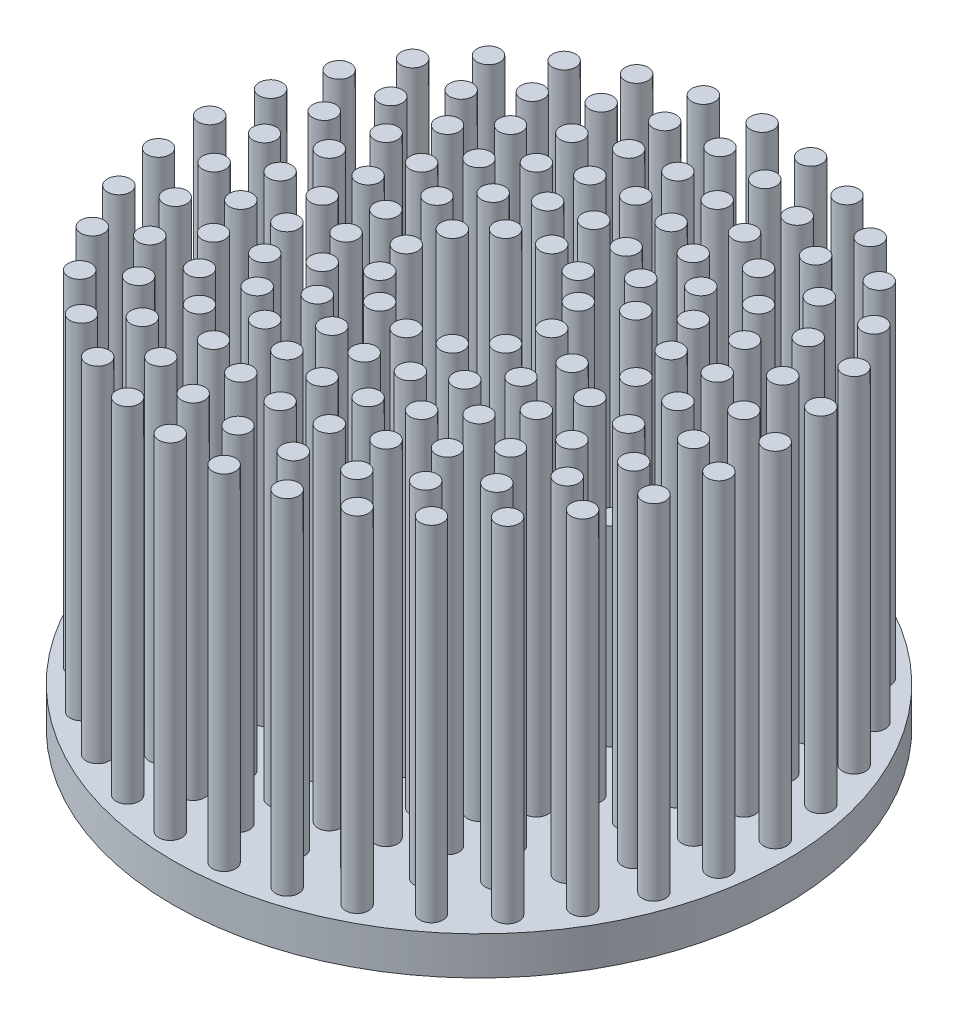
from build123d import *

# Parameters (mm, degrees)
SKETCH_1_R                = 40
EXTRUDE_1_DEPTH           = 3
SKETCH_2_R                = 1.5
EXTRUDE_2_DEPTH           = 27
SKETCH_6_R                = 1.5
EXTRUDE_4_DEPTH           = 27
PATTERN_CIRCULAR_3_COUNT  = 6
SKETCH_7_R                = 1.5
EXTRUDE_5_DEPTH           = 27
PATTERN_CIRCULAR_4_COUNT  = 12
SKETCH_8_R                = 1.5
EXTRUDE_6_DEPTH           = 27
PATTERN_CIRCULAR_5_COUNT  = 18
SKETCH_10_R               = 1.5
EXTRUDE_7_DEPTH           = 27
PATTERN_CIRCULAR_6_COUNT  = 24
SKETCH_11_R               = 1.5
EXTRUDE_8_DEPTH           = 27
PATTERN_CIRCULAR_7_COUNT  = 28
SKETCH_13_R               = 7
CUT_EXTRUDE_3_DEPTH       = 27
SKETCH_15_R               = 1.5
EXTRUDE_10_DEPTH          = 27
PATTERN_CIRCULAR_8_COUNT  = 5
SKETCH_23_R               = 1.5
EXTRUDE_16_DEPTH          = 27
PATTERN_CIRCULAR_9_COUNT  = 30
SKETCH_26_R               = 1.5
EXTRUDE_17_DEPTH          = 27
PATTERN_CIRCULAR_10_COUNT = 33
SKETCH_29_R               = 1.5
EXTRUDE_19_DEPTH          = 37
SKETCH_30_R               = 40
EXTRUDE_20_DEPTH          = 2
M2X0_4_TAPPED_HOLE1_D     = 1.6
M2X0_4_TAPPED_HOLE1_DEPTH = 6
M2X0_4_TAPPED_HOLE1_TIP   = 0.480688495
SKETCH6_R                 = 5.75
EXTRUDE2_DEPTH            = 70.282032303
SKETCH7_R                 = 45.51337789
EXTRUDE3_DEPTH            = 10
SKETCH8_R                 = 1.5
EXTRUDE4_DEPTH            = 20


with BuildPart() as part:
    # Sketch 1 → Extrude 1 (new body)
    with BuildSketch(Plane(origin=(0, 0, 0), x_dir=(1, 0, 0), z_dir=(0, 1, 0))):
        with Locations(Location((0, 0, 0), (0, 0, 270))):
            Circle(SKETCH_1_R)
    extrude(amount=EXTRUDE_1_DEPTH)

    # Sketch 2 → Extrude 2 (add)
    with BuildSketch(Plane(origin=(0, 3, 0), x_dir=(1, 0, 0), z_dir=(0, 1, 0))):
        with Locations(Location((0, 0, 0), (0, 0, 270))):
            Circle(SKETCH_2_R)
    extrude(amount=EXTRUDE_2_DEPTH)

    # Sketch 6 → Extrude 4 (add)
    with BuildSketch(Plane(origin=(0, 3, 0), x_dir=(1, 0, 0), z_dir=(0, 1, 0))):
        with Locations(Location((0, 5.5, 0), (0, 0, 270))):
            Circle(SKETCH_6_R)
    extrude_4 = extrude(amount=EXTRUDE_4_DEPTH)

    # Pattern Circular 3: Extrude 4 ×6 about axis
    pattern_circular_3_axis = Axis((0, 0, 0), (0, 1, 0))
    for i in range(1, PATTERN_CIRCULAR_3_COUNT):
        add(extrude_4.rotate(pattern_circular_3_axis, i * 360 / PATTERN_CIRCULAR_3_COUNT))

    # Sketch 7 → Extrude 5 (add)
    with BuildSketch(Plane(origin=(0, 3, 0), x_dir=(1, 0, 0), z_dir=(0, 1, 0))):
        with Locations(Location((0, 9.5, 0), (0, 0, 270))):
            Circle(SKETCH_7_R)
    extrude_5 = extrude(amount=EXTRUDE_5_DEPTH)

    # Pattern Circular 4: Extrude 5 ×12 about axis
    pattern_circular_4_axis = Axis((0, 0, 0), (0, 1, 0))
    for i in range(1, PATTERN_CIRCULAR_4_COUNT):
        add(extrude_5.rotate(pattern_circular_4_axis, i * 360 / PATTERN_CIRCULAR_4_COUNT))

    # Sketch 8 → Extrude 6 (add)
    with BuildSketch(Plane(origin=(0, 3, 0), x_dir=(1, 0, 0), z_dir=(0, 1, 0))):
        with Locations(Location((0, 15, 0), (0, 0, 270))):
            Circle(SKETCH_8_R)
    extrude_6 = extrude(amount=EXTRUDE_6_DEPTH)

    # Pattern Circular 5: Extrude 6 ×18 about axis
    pattern_circular_5_axis = Axis((0, 0, 0), (0, 1, 0))
    for i in range(1, PATTERN_CIRCULAR_5_COUNT):
        add(extrude_6.rotate(pattern_circular_5_axis, i * 360 / PATTERN_CIRCULAR_5_COUNT))

    # Sketch 10 → Extrude 7 (add)
    with BuildSketch(Plane(origin=(0, 3, 0), x_dir=(1, 0, 0), z_dir=(0, 1, 0))):
        with Locations(Location((0, 20.5, 0), (0, 0, 270))):
            Circle(SKETCH_10_R)
    extrude_7 = extrude(amount=EXTRUDE_7_DEPTH)

    # Pattern Circular 6: Extrude 7 ×24 about axis
    pattern_circular_6_axis = Axis((0, 0, 0), (0, 1, 0))
    for i in range(1, PATTERN_CIRCULAR_6_COUNT):
        add(extrude_7.rotate(pattern_circular_6_axis, i * 360 / PATTERN_CIRCULAR_6_COUNT))

    # Sketch 11 → Extrude 8 (add)
    with BuildSketch(Plane(origin=(0, 3, 0), x_dir=(1, 0, 0), z_dir=(0, 1, 0))):
        with Locations(Location((0, 26, 0), (0, 0, 270))):
            Circle(SKETCH_11_R)
    extrude_8 = extrude(amount=EXTRUDE_8_DEPTH)

    # Pattern Circular 7: Extrude 8 ×28 about axis
    pattern_circular_7_axis = Axis((0, 0, 0), (0, 1, 0))
    for i in range(1, PATTERN_CIRCULAR_7_COUNT):
        add(extrude_8.rotate(pattern_circular_7_axis, i * 360 / PATTERN_CIRCULAR_7_COUNT))

    # Sketch 13 → Cut-Extrude 3 (cut)
    with BuildSketch(Plane(origin=(0, 3, 0), x_dir=(1, 0, 0), z_dir=(0, 1, 0))):
        Circle(SKETCH_13_R)
    extrude(amount=CUT_EXTRUDE_3_DEPTH, mode=Mode.SUBTRACT)

    # Sketch 15 → Extrude 10 (add)
    with BuildSketch(Plane(origin=(0, 3, 0), x_dir=(1, 0, 0), z_dir=(0, 1, 0))):
        with Locations(Location((0, 4, 0), (0, 0, 270))):
            Circle(SKETCH_15_R)
    extrude_10 = extrude(amount=EXTRUDE_10_DEPTH)

    # Pattern Circular 8: Extrude 10 ×5 about axis
    pattern_circular_8_axis = Axis((0, 0, 0), (0, 1, 0))
    for i in range(1, PATTERN_CIRCULAR_8_COUNT):
        add(extrude_10.rotate(pattern_circular_8_axis, i * 360 / PATTERN_CIRCULAR_8_COUNT))

    # Sketch 23 → Extrude 16 (add)
    with BuildSketch(Plane(origin=(0, 3, 0), x_dir=(1, 0, 0), z_dir=(0, 1, 0))):
        with Locations(Location((0, 31.5, 0), (0, 0, 270))):
            Circle(SKETCH_23_R)
    extrude_16 = extrude(amount=EXTRUDE_16_DEPTH)

    # Pattern Circular 9: Extrude 16 ×30 about axis
    pattern_circular_9_axis = Axis((0, 0, 0), (0, 1, 0))
    for i in range(1, PATTERN_CIRCULAR_9_COUNT):
        add(extrude_16.rotate(pattern_circular_9_axis, i * 360 / PATTERN_CIRCULAR_9_COUNT))

    # Sketch 26 → Extrude 17 (add)
    with BuildSketch(Plane(origin=(0, 3, 0), x_dir=(1, 0, 0), z_dir=(0, 1, 0))):
        with Locations(Location((0, 37, 0), (0, 0, 270))):
            Circle(SKETCH_26_R)
    extrude_17 = extrude(amount=EXTRUDE_17_DEPTH)

    # Pattern Circular 10: Extrude 17 ×33 about axis
    pattern_circular_10_axis = Axis((0, 0, 0), (0, 1, 0))
    for i in range(1, PATTERN_CIRCULAR_10_COUNT):
        add(extrude_17.rotate(pattern_circular_10_axis, i * 360 / PATTERN_CIRCULAR_10_COUNT))

    # Sketch 29 → Extrude 19 (add)
    with BuildSketch(Plane(origin=(0, 3, 0), x_dir=(1, 0, 0), z_dir=(0, 1, 0))):
        with Locations(Location((-17.753520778, -10.25, 0), (0, 0, 30))):
            Circle(SKETCH_29_R)
        with Locations(Location((-14.772116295, -2.604722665, 0), (0, 0, 10))):
            Circle(SKETCH_29_R)
        with Locations(Location((-19.801479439, -5.305790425, 0), (0, 0, 15))):
            Circle(SKETCH_29_R)
        with Locations(Location((-19.801479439, 5.305790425, 0), (0, 0, 345))):
            Circle(SKETCH_29_R)
        with Locations(Location((-17.753520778, 10.25, 0), (0, 0, 330))):
            Circle(SKETCH_29_R)
        with Locations(Location((-12.990381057, 7.5, 0), (0, 0, 330))):
            Circle(SKETCH_29_R)
        with Locations(Location((-9.641814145, 11.490666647, 0), (0, 0, 310))):
            Circle(SKETCH_29_R)
        with Locations(Location((-14.495689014, 14.495689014, 0), (0, 0, 315))):
            Circle(SKETCH_29_R)
        with Locations(Location((-10.25, 17.753520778, 0), (0, 0, 300))):
            Circle(SKETCH_29_R)
        with Locations(Location((-4.75, 8.227241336, 0), (0, 0, 300))):
            Circle(SKETCH_29_R)
        with Locations(Location((9.641814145, 11.490666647, 0), (0, 0, 230))):
            Circle(SKETCH_29_R)
        with Locations(Location((12.990381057, 7.5, 0), (0, 0, 210))):
            Circle(SKETCH_29_R)
        with Locations(Location((14.772116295, 2.604722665, 0), (0, 0, 190))):
            Circle(SKETCH_29_R)
        with Locations(Location((8.227241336, 4.75, 0), (0, 0, 210))):
            Circle(SKETCH_29_R)
        with Locations(Location((3.804226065, 1.236067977, 0), (0, 0, 198))):
            Circle(SKETCH_29_R)
        with Locations(Location((19.801479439, -5.305790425, 0), (0, 0, 165))):
            Circle(SKETCH_29_R)
        with Locations(Location((0, 26, 0), (0, 0, 270))):
            Circle(SKETCH_29_R)
        with Locations(Location((-6.549218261, 30.811649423, 0), (0, 0, 282))):
            Circle(SKETCH_29_R)
        with Locations(Location((-5.305790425, -19.801479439, 0), (0, 0, 75))):
            Circle(SKETCH_29_R)
        with Locations(Location((12.990381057, -7.5, 0), (0, 0, 150))):
            Circle(SKETCH_29_R)
        with Locations(Location((9.641814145, -11.490666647, 0), (0, 0, 130))):
            Circle(SKETCH_29_R)
        with Locations(Location((5.13030215, -14.095389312, 0), (0, 0, 110))):
            Circle(SKETCH_29_R)
        with Locations(Location((0, -9.5, 0), (0, 0, 90))):
            Circle(SKETCH_29_R)
        with Locations(Location((8.227241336, -4.75, 0), (0, 0, 150))):
            Circle(SKETCH_29_R)
        with Locations(Location((2.351141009, -3.236067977, 0), (0, 0, 126))):
            Circle(SKETCH_29_R)
        with Locations(Location((0, 4, 0), (0, 0, 270))):
            Circle(SKETCH_29_R)
        with Locations(Location((-8.227241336, 4.75, 0), (0, 0, 330))):
            Circle(SKETCH_29_R)
        with Locations((-9.5, 0)):
            Circle(SKETCH_29_R)
        with Locations(Location((-8.227241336, -4.75, 0), (0, 0, 30))):
            Circle(SKETCH_29_R)
        with Locations(Location((-4.75, -8.227241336, 0), (0, 0, 60))):
            Circle(SKETCH_29_R)
        with Locations(Location((-5.13030215, -14.095389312, 0), (0, 0, 70))):
            Circle(SKETCH_29_R)
        with Locations(Location((-10.25, -17.753520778, 0), (0, 0, 60))):
            Circle(SKETCH_29_R)
        with Locations(Location((-23.425190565, -11.280977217, 0), (0, 0, 25.714285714))):
            Circle(SKETCH_29_R)
        with Locations(Location((-29.958280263, -9.734035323, 0), (0, 0, 18))):
            Circle(SKETCH_29_R)
        with Locations((-26, 0)):
            Circle(SKETCH_29_R)
        with Locations(Location((-23.425190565, 11.280977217, 0), (0, 0, 334.285714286))):
            Circle(SKETCH_29_R)
        with Locations(Location((-18.515235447, 25.484035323, 0), (0, 0, 306))):
            Circle(SKETCH_29_R)
        with Locations(Location((-12.812204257, 28.776681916, 0), (0, 0, 294))):
            Circle(SKETCH_29_R)
        with Locations(Location((5.13030215, 14.095389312, 0), (0, 0, 250))):
            Circle(SKETCH_29_R)
        with Locations(Location((5.305790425, 19.801479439, 0), (0, 0, 255))):
            Circle(SKETCH_29_R)
        with Locations(Location((10.25, 17.753520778, 0), (0, 0, 240))):
            Circle(SKETCH_29_R)
        with Locations(Location((14.495689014, 14.495689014, 0), (0, 0, 225))):
            Circle(SKETCH_29_R)
        with Locations(Location((19.801479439, 5.305790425, 0), (0, 0, 195))):
            Circle(SKETCH_29_R)
        with Locations(Location((29.958280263, 9.734035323, 0), (0, 0, 198))):
            Circle(SKETCH_29_R)
        with Locations(Location((23.425190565, 11.280977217, 0), (0, 0, 205.714285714))):
            Circle(SKETCH_29_R)
        with Locations(Location((20.327618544, 16.210734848, 0), (0, 0, 218.571428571))):
            Circle(SKETCH_29_R)
        with Locations(Location((16.210734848, 20.327618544, 0), (0, 0, 231.428571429))):
            Circle(SKETCH_29_R)
        with Locations(Location((5.785544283, 25.348125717, 0), (0, 0, 257.142857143))):
            Circle(SKETCH_29_R)
        with Locations(Location((0, 9.5, 0), (0, 0, 270))):
            Circle(SKETCH_29_R)
        with Locations(Location((4.75, 8.227241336, 0), (0, 0, 240))):
            Circle(SKETCH_29_R)
        with Locations(Location((9.5, 0, 0), (0, 0, 180))):
            Circle(SKETCH_29_R)
        with Locations(Location((14.772116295, -2.604722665, 0), (0, 0, 170))):
            Circle(SKETCH_29_R)
        with Locations(Location((20.5, 0, 0), (0, 0, 180))):
            Circle(SKETCH_29_R)
        with Locations(Location((25.348125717, -5.785544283, 0), (0, 0, 167.142857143))):
            Circle(SKETCH_29_R)
        with Locations(Location((23.425190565, -11.280977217, 0), (0, 0, 154.285714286))):
            Circle(SKETCH_29_R)
        with Locations(Location((12.812204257, -28.776681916, 0), (0, 0, 114))):
            Circle(SKETCH_29_R)
        with Locations(Location((6.549218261, -30.811649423, 0), (0, 0, 102))):
            Circle(SKETCH_29_R)
        with Locations(Location((5.785544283, -25.348125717, 0), (0, 0, 102.857142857))):
            Circle(SKETCH_29_R)
        with Locations(Location((0, -31.5, 0), (0, 0, 90))):
            Circle(SKETCH_29_R)
        with Locations(Location((-6.549218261, -30.811649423, 0), (0, 0, 78))):
            Circle(SKETCH_29_R)
        with Locations(Location((-12.812204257, -28.776681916, 0), (0, 0, 66))):
            Circle(SKETCH_29_R)
        with Locations(Location((-18.515235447, -25.484035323, 0), (0, 0, 54))):
            Circle(SKETCH_29_R)
        with Locations(Location((-16.210734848, -20.327618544, 0), (0, 0, 51.428571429))):
            Circle(SKETCH_29_R)
        with Locations(Location((-23.409062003, -21.0776141, 0), (0, 0, 42))):
            Circle(SKETCH_29_R)
        with Locations(Location((0, -20.5, 0), (0, 0, 90))):
            Circle(SKETCH_29_R)
        with Locations(Location((5.305790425, -19.801479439, 0), (0, 0, 105))):
            Circle(SKETCH_29_R)
        with Locations(Location((10.25, -17.753520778, 0), (0, 0, 120))):
            Circle(SKETCH_29_R)
        with Locations(Location((14.495689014, -14.495689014, 0), (0, 0, 135))):
            Circle(SKETCH_29_R)
        with Locations(Location((17.753520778, -10.25, 0), (0, 0, 150))):
            Circle(SKETCH_29_R)
        with Locations(Location((0, -15, 0), (0, 0, 90))):
            Circle(SKETCH_29_R)
        with Locations(Location((4.75, -8.227241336, 0), (0, 0, 120))):
            Circle(SKETCH_29_R)
        with Locations(Location((-2.351141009, -3.236067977, 0), (0, 0, 54))):
            Circle(SKETCH_29_R)
        with Locations(Location((-3.804226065, 1.236067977, 0), (0, 0, 342))):
            Circle(SKETCH_29_R)
        with Locations(Location((-14.495689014, -14.495689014, 0), (0, 0, 45))):
            Circle(SKETCH_29_R)
        with Locations(Location((-9.641814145, -11.490666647, 0), (0, 0, 50))):
            Circle(SKETCH_29_R)
        with Locations(Location((-12.990381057, -7.5, 0), (0, 0, 30))):
            Circle(SKETCH_29_R)
        with Locations((-20.5, 0)):
            Circle(SKETCH_29_R)
        with Locations(Location((-14.772116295, 2.604722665, 0), (0, 0, 350))):
            Circle(SKETCH_29_R)
        with Locations(Location((-5.13030215, 14.095389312, 0), (0, 0, 290))):
            Circle(SKETCH_29_R)
        with Locations(Location((-25.532923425, 26.77815941, 0), (0, 0, 313.636363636))):
            Circle(SKETCH_29_R)
        with Locations(Location((-30.139310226, 21.462105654, 0), (0, 0, 324.545454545))):
            Circle(SKETCH_29_R)
        with Locations(Location((-33.656383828, 15.370355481, 0), (0, 0, 335.454545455))):
            Circle(SKETCH_29_R)
        with Locations(Location((-35.957028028, 8.723080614, 0), (0, 0, 346.363636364))):
            Circle(SKETCH_29_R)
        with Locations(Location((-36.95809155, 1.760530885, 0), (0, 0, 357.272727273))):
            Circle(SKETCH_29_R)
        with Locations(Location((-22.87188249, -29.083964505, 0), (0, 0, 51.818181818))):
            Circle(SKETCH_29_R)
        with Locations(Location((-10.424104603, -35.501240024, 0), (0, 0, 73.636363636))):
            Circle(SKETCH_29_R)
        with Locations(Location((-3.517073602, -36.832461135, 0), (0, 0, 84.545454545))):
            Circle(SKETCH_29_R)
        with Locations(Location((22.87188249, -29.083964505, 0), (0, 0, 128.181818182))):
            Circle(SKETCH_29_R)
        with Locations(Location((36.62339335, -5.265649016, 0), (0, 0, 171.818181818))):
            Circle(SKETCH_29_R)
        with Locations(Location((20.003710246, 31.126380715, 0), (0, 0, 237.272727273))):
            Circle(SKETCH_29_R)
        with Locations(Location((13.751510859, 34.349613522, 0), (0, 0, 248.181818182))):
            Circle(SKETCH_29_R)
        with Locations(Location((7.002296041, 36.331361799, 0), (0, 0, 259.090909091))):
            Circle(SKETCH_29_R)
        with Locations(Location((0, 37, 0), (0, 0, 270))):
            Circle(SKETCH_29_R)
        with Locations(Location((-20.003710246, 31.126380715, 0), (0, 0, 302.727272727))):
            Circle(SKETCH_29_R)
        with Locations(Location((-32.04293994, -18.5, 0), (0, 0, 30))):
            Circle(SKETCH_29_R)
        with Locations(Location((-27.962734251, -24.229847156, 0), (0, 0, 40.909090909))):
            Circle(SKETCH_29_R)
        with Locations(Location((-16.954381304, -32.8869116, 0), (0, 0, 62.727272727))):
            Circle(SKETCH_29_R)
        with Locations(Location((3.517073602, -36.832461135, 0), (0, 0, 95.454545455))):
            Circle(SKETCH_29_R)
        with Locations(Location((10.424104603, -35.501240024, 0), (0, 0, 106.363636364))):
            Circle(SKETCH_29_R)
        with Locations(Location((16.954381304, -32.8869116, 0), (0, 0, 117.272727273))):
            Circle(SKETCH_29_R)
        with Locations(Location((27.962734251, -24.229847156, 0), (0, 0, 139.090909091))):
            Circle(SKETCH_29_R)
        with Locations(Location((32.04293994, -18.5, 0), (0, 0, 150))):
            Circle(SKETCH_29_R)
        with Locations(Location((34.965030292, -12.101514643, 0), (0, 0, 160.909090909))):
            Circle(SKETCH_29_R)
        with Locations(Location((36.95809155, 1.760530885, 0), (0, 0, 182.727272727))):
            Circle(SKETCH_29_R)
        with Locations(Location((35.957028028, 8.723080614, 0), (0, 0, 193.636363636))):
            Circle(SKETCH_29_R)
        with Locations(Location((33.656383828, 15.370355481, 0), (0, 0, 204.545454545))):
            Circle(SKETCH_29_R)
        with Locations(Location((30.139310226, 21.462105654, 0), (0, 0, 215.454545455))):
            Circle(SKETCH_29_R)
        with Locations(Location((25.532923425, 26.77815941, 0), (0, 0, 226.363636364))):
            Circle(SKETCH_29_R)
        with Locations(Location((-7.002296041, 36.331361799, 0), (0, 0, 280.909090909))):
            Circle(SKETCH_29_R)
        with Locations(Location((-13.751510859, 34.349613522, 0), (0, 0, 291.818181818))):
            Circle(SKETCH_29_R)
        with Locations(Location((-36.62339335, -5.265649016, 0), (0, 0, 8.181818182))):
            Circle(SKETCH_29_R)
        with Locations(Location((-34.965030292, -12.101514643, 0), (0, 0, 19.090909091))):
            Circle(SKETCH_29_R)
        with Locations(Location((23.409062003, 21.0776141, 0), (0, 0, 222))):
            Circle(SKETCH_29_R)
        with Locations(Location((18.515235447, 25.484035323, 0), (0, 0, 234))):
            Circle(SKETCH_29_R)
        with Locations(Location((11.280977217, 23.425190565, 0), (0, 0, 244.285714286))):
            Circle(SKETCH_29_R)
        with Locations(Location((12.812204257, 28.776681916, 0), (0, 0, 246))):
            Circle(SKETCH_29_R)
        with Locations(Location((6.549218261, 30.811649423, 0), (0, 0, 258))):
            Circle(SKETCH_29_R)
        with Locations(Location((0, 31.5, 0), (0, 0, 270))):
            Circle(SKETCH_29_R)
        with Locations(Location((-31.327439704, -3.292646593, 0), (0, 0, 6))):
            Circle(SKETCH_29_R)
        with Locations(Location((-31.327439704, 3.292646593, 0), (0, 0, 354))):
            Circle(SKETCH_29_R)
        with Locations(Location((-29.958280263, 9.734035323, 0), (0, 0, 342))):
            Circle(SKETCH_29_R)
        with Locations(Location((-25.348125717, 5.785544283, 0), (0, 0, 347.142857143))):
            Circle(SKETCH_29_R)
        with Locations(Location((-27.279800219, 15.75, 0), (0, 0, 330))):
            Circle(SKETCH_29_R)
        with Locations(Location((-20.327618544, 16.210734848, 0), (0, 0, 321.428571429))):
            Circle(SKETCH_29_R)
        with Locations(Location((-23.409062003, 21.0776141, 0), (0, 0, 318))):
            Circle(SKETCH_29_R)
        with Locations(Location((-16.210734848, 20.327618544, 0), (0, 0, 308.571428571))):
            Circle(SKETCH_29_R)
        with Locations(Location((-11.280977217, 23.425190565, 0), (0, 0, 295.714285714))):
            Circle(SKETCH_29_R)
        with Locations(Location((-5.785544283, 25.348125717, 0), (0, 0, 282.857142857))):
            Circle(SKETCH_29_R)
        with Locations(Location((-5.305790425, 19.801479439, 0), (0, 0, 285))):
            Circle(SKETCH_29_R)
        with Locations(Location((0, 20.5, 0), (0, 0, 270))):
            Circle(SKETCH_29_R)
        with Locations(Location((0, 15, 0), (0, 0, 270))):
            Circle(SKETCH_29_R)
        with Locations(Location((17.753520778, 10.25, 0), (0, 0, 210))):
            Circle(SKETCH_29_R)
        with Locations(Location((25.348125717, 5.785544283, 0), (0, 0, 192.857142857))):
            Circle(SKETCH_29_R)
        with Locations(Location((27.279800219, 15.75, 0), (0, 0, 210))):
            Circle(SKETCH_29_R)
        with Locations(Location((26, 0, 0), (0, 0, 180))):
            Circle(SKETCH_29_R)
        with Locations(Location((31.327439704, -3.292646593, 0), (0, 0, 174))):
            Circle(SKETCH_29_R)
        with Locations(Location((31.327439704, 3.292646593, 0), (0, 0, 186))):
            Circle(SKETCH_29_R)
        with Locations(Location((29.958280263, -9.734035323, 0), (0, 0, 162))):
            Circle(SKETCH_29_R)
        with Locations(Location((27.279800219, -15.75, 0), (0, 0, 150))):
            Circle(SKETCH_29_R)
        with Locations(Location((20.327618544, -16.210734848, 0), (0, 0, 141.428571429))):
            Circle(SKETCH_29_R)
        with Locations(Location((23.409062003, -21.0776141, 0), (0, 0, 138))):
            Circle(SKETCH_29_R)
        with Locations(Location((16.210734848, -20.327618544, 0), (0, 0, 128.571428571))):
            Circle(SKETCH_29_R)
        with Locations(Location((18.515235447, -25.484035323, 0), (0, 0, 126))):
            Circle(SKETCH_29_R)
        with Locations(Location((11.280977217, -23.425190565, 0), (0, 0, 115.714285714))):
            Circle(SKETCH_29_R)
        with Locations(Location((0, -26, 0), (0, 0, 90))):
            Circle(SKETCH_29_R)
        with Locations(Location((-5.785544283, -25.348125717, 0), (0, 0, 77.142857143))):
            Circle(SKETCH_29_R)
        with Locations(Location((-11.280977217, -23.425190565, 0), (0, 0, 64.285714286))):
            Circle(SKETCH_29_R)
        with Locations(Location((-20.327618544, -16.210734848, 0), (0, 0, 38.571428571))):
            Circle(SKETCH_29_R)
        with Locations(Location((-27.279800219, -15.75, 0), (0, 0, 30))):
            Circle(SKETCH_29_R)
        with Locations(Location((-25.348125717, -5.785544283, 0), (0, 0, 12.857142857))):
            Circle(SKETCH_29_R)
    extrude(amount=EXTRUDE_19_DEPTH)

    # Sketch 30 → Extrude 20 (add)
    with BuildSketch(Plane(origin=(0, 3, 0), x_dir=(1, 0, 0), z_dir=(0, 1, 0))):
        with Locations(Location((0, 0, 0), (0, 0, 270))):
            Circle(SKETCH_30_R)
    extrude(amount=EXTRUDE_20_DEPTH)

    # M2x0.4 Tapped Hole1
    with Locations(Plane.XZ):
        with Locations((-2.545260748, 19.333174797), (-15.470390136, -11.870847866), (18.015650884, -7.462326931)):
            Hole(M2X0_4_TAPPED_HOLE1_D / 2, depth=M2X0_4_TAPPED_HOLE1_DEPTH)
            with Locations((0, 0, -(M2X0_4_TAPPED_HOLE1_DEPTH + M2X0_4_TAPPED_HOLE1_TIP / 2))):  # 118° drill point
                Cone(0, M2X0_4_TAPPED_HOLE1_D / 2, M2X0_4_TAPPED_HOLE1_TIP, mode=Mode.SUBTRACT)

    # Sketch6 → Extrude2 (cut, through all)
    with BuildSketch(Plane.XZ):
        with Locations(Location((0, 0, 0), (0, 0, 270))):
            Circle(SKETCH6_R)
    extrude(amount=-EXTRUDE2_DEPTH, mode=Mode.SUBTRACT)

    # Sketch7 → Extrude3 (cut)
    with BuildSketch(Plane(origin=(0, 40, 0), x_dir=(1, 0, 0), z_dir=(0, 1, 0))):
        Circle(SKETCH7_R)
    extrude(amount=-EXTRUDE3_DEPTH, mode=Mode.SUBTRACT)

    # Sketch8 → Extrude4 (add)
    with BuildSketch(Plane(origin=(0, 30, 0), x_dir=(1, 0, 0), z_dir=(0, 1, 0))):
        with Locations(Location((3.517073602, -36.832461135, 0), (0, 0, 270))):
            Circle(SKETCH8_R)
        with Locations(Location((-12.812204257, -28.776681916, 0), (0, 0, 270))):
            Circle(SKETCH8_R)
        with Locations(Location((-6.549218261, -30.811649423, 0), (0, 0, 270))):
            Circle(SKETCH8_R)
        with Locations(Location((-10.424104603, -35.501240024, 0), (0, 0, 270))):
            Circle(SKETCH8_R)
        with Locations(Location((-3.517073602, -36.832461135, 0), (0, 0, 270))):
            Circle(SKETCH8_R)
        with Locations(Location((-16.954381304, -32.8869116, 0), (0, 0, 270))):
            Circle(SKETCH8_R)
        with Locations(Location((-22.87188249, -29.083964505, 0), (0, 0, 270))):
            Circle(SKETCH8_R)
        with Locations(Location((-18.515235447, -25.484035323, 0), (0, 0, 270))):
            Circle(SKETCH8_R)
        with Locations(Location((-23.409062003, -21.0776141, 0), (0, 0, 270))):
            Circle(SKETCH8_R)
        with Locations(Location((-27.962734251, -24.229847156, 0), (0, 0, 270))):
            Circle(SKETCH8_R)
        with Locations(Location((-27.279800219, -15.75, 0), (0, 0, 270))):
            Circle(SKETCH8_R)
        with Locations(Location((-32.04293994, -18.5, 0), (0, 0, 270))):
            Circle(SKETCH8_R)
        with Locations(Location((-23.425190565, -11.280977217, 0), (0, 0, 270))):
            Circle(SKETCH8_R)
        with Locations(Location((-20.327618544, -16.210734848, 0), (0, 0, 270))):
            Circle(SKETCH8_R)
        with Locations(Location((-16.210734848, -20.327618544, 0), (0, 0, 270))):
            Circle(SKETCH8_R)
        with Locations(Location((-14.495689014, -14.495689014, 0), (0, 0, 270))):
            Circle(SKETCH8_R)
        with Locations(Location((-10.25, -17.753520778, 0), (0, 0, 270))):
            Circle(SKETCH8_R)
        with Locations(Location((-11.280977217, -23.425190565, 0), (0, 0, 270))):
            Circle(SKETCH8_R)
        with Locations(Location((-5.785544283, -25.348125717, 0), (0, 0, 270))):
            Circle(SKETCH8_R)
        with Locations(Location((-5.305790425, -19.801479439, 0), (0, 0, 270))):
            Circle(SKETCH8_R)
        with Locations(Location((0, -26, 0), (0, 0, 270))):
            Circle(SKETCH8_R)
        with Locations(Location((0, -31.5, 0), (0, 0, 270))):
            Circle(SKETCH8_R)
        with Locations(Location((6.549218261, -30.811649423, 0), (0, 0, 270))):
            Circle(SKETCH8_R)
        with Locations(Location((5.305790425, -19.801479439, 0), (0, 0, 270))):
            Circle(SKETCH8_R)
        with Locations(Location((10.424104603, -35.501240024, 0), (0, 0, 270))):
            Circle(SKETCH8_R)
        with Locations(Location((10.25, -17.753520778, 0), (0, 0, 270))):
            Circle(SKETCH8_R)
        with Locations(Location((16.954381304, -32.8869116, 0), (0, 0, 270))):
            Circle(SKETCH8_R)
        with Locations(Location((18.515235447, -25.484035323, 0), (0, 0, 270))):
            Circle(SKETCH8_R)
        with Locations(Location((22.87188249, -29.083964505, 0), (0, 0, 270))):
            Circle(SKETCH8_R)
        with Locations(Location((27.962734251, -24.229847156, 0), (0, 0, 270))):
            Circle(SKETCH8_R)
        with Locations(Location((23.409062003, -21.0776141, 0), (0, 0, 270))):
            Circle(SKETCH8_R)
        with Locations(Location((20.327618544, -16.210734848, 0), (0, 0, 270))):
            Circle(SKETCH8_R)
        with Locations(Location((16.210734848, -20.327618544, 0), (0, 0, 270))):
            Circle(SKETCH8_R)
        with Locations(Location((17.753520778, -10.25, 0), (0, 0, 270))):
            Circle(SKETCH8_R)
        with Locations(Location((23.425190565, -11.280977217, 0), (0, 0, 270))):
            Circle(SKETCH8_R)
        with Locations(Location((27.279800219, -15.75, 0), (0, 0, 270))):
            Circle(SKETCH8_R)
        with Locations(Location((29.958280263, -9.734035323, 0), (0, 0, 270))):
            Circle(SKETCH8_R)
        with Locations(Location((34.965030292, -12.101514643, 0), (0, 0, 270))):
            Circle(SKETCH8_R)
        with Locations(Location((36.62339335, -5.265649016, 0), (0, 0, 270))):
            Circle(SKETCH8_R)
        with Locations(Location((31.327439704, -3.292646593, 0), (0, 0, 270))):
            Circle(SKETCH8_R)
        with Locations(Location((25.348125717, -5.785544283, 0), (0, 0, 270))):
            Circle(SKETCH8_R)
        with Locations(Location((19.801479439, -5.305790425, 0), (0, 0, 270))):
            Circle(SKETCH8_R)
        with Locations(Location((20.5, 0, 0), (0, 0, 270))):
            Circle(SKETCH8_R)
        with Locations(Location((14.772116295, -2.604722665, 0), (0, 0, 270))):
            Circle(SKETCH8_R)
        with Locations(Location((12.990381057, -7.5, 0), (0, 0, 270))):
            Circle(SKETCH8_R)
        with Locations(Location((9.641814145, -11.490666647, 0), (0, 0, 270))):
            Circle(SKETCH8_R)
        with Locations(Location((0, -9.5, 0), (0, 0, 270))):
            Circle(SKETCH8_R)
        with Locations(Location((4.75, -8.227241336, 0), (0, 0, 270))):
            Circle(SKETCH8_R)
        with Locations(Location((8.227241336, -4.75, 0), (0, 0, 270))):
            Circle(SKETCH8_R)
        with Locations(Location((-5.13030215, -14.095389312, 0), (0, 0, 270))):
            Circle(SKETCH8_R)
        with Locations(Location((-9.641814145, -11.490666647, 0), (0, 0, 270))):
            Circle(SKETCH8_R)
        with Locations(Location((-12.990381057, -7.5, 0), (0, 0, 270))):
            Circle(SKETCH8_R)
        with Locations(Location((-17.753520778, -10.25, 0), (0, 0, 270))):
            Circle(SKETCH8_R)
        with Locations(Location((-8.227241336, -4.75, 0), (0, 0, 270))):
            Circle(SKETCH8_R)
        with Locations(Location((-9.5, 0, 0), (0, 0, 270))):
            Circle(SKETCH8_R)
        with Locations(Location((-14.772116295, -2.604722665, 0), (0, 0, 270))):
            Circle(SKETCH8_R)
        with Locations(Location((-14.772116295, 2.604722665, 0), (0, 0, 270))):
            Circle(SKETCH8_R)
        with Locations(Location((-20.5, 0, 0), (0, 0, 270))):
            Circle(SKETCH8_R)
        with Locations(Location((-19.801479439, -5.305790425, 0), (0, 0, 270))):
            Circle(SKETCH8_R)
        with Locations(Location((-26, 0, 0), (0, 0, 270))):
            Circle(SKETCH8_R)
        with Locations(Location((-31.327439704, -3.292646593, 0), (0, 0, 270))):
            Circle(SKETCH8_R)
        with Locations(Location((-29.958280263, -9.734035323, 0), (0, 0, 270))):
            Circle(SKETCH8_R)
        with Locations(Location((25.348125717, 5.785544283, 0), (0, 0, 270))):
            Circle(SKETCH8_R)
        with Locations(Location((31.327439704, 3.292646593, 0), (0, 0, 270))):
            Circle(SKETCH8_R)
        with Locations(Location((36.95809155, 1.760530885, 0), (0, 0, 270))):
            Circle(SKETCH8_R)
        with Locations(Location((33.656383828, 15.370355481, 0), (0, 0, 270))):
            Circle(SKETCH8_R)
        with Locations(Location((30.139310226, 21.462105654, 0), (0, 0, 270))):
            Circle(SKETCH8_R)
        with Locations(Location((25.532923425, 26.77815941, 0), (0, 0, 270))):
            Circle(SKETCH8_R)
        with Locations(Location((18.515235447, 25.484035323, 0), (0, 0, 270))):
            Circle(SKETCH8_R)
        with Locations(Location((16.210734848, 20.327618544, 0), (0, 0, 270))):
            Circle(SKETCH8_R)
        with Locations(Location((20.327618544, 16.210734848, 0), (0, 0, 270))):
            Circle(SKETCH8_R)
        with Locations(Location((17.753520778, 10.25, 0), (0, 0, 270))):
            Circle(SKETCH8_R)
        with Locations(Location((14.495689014, 14.495689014, 0), (0, 0, 270))):
            Circle(SKETCH8_R)
        with Locations(Location((9.641814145, 11.490666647, 0), (0, 0, 270))):
            Circle(SKETCH8_R)
        with Locations(Location((12.990381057, 7.5, 0), (0, 0, 270))):
            Circle(SKETCH8_R)
        with Locations(Location((19.801479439, 5.305790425, 0), (0, 0, 270))):
            Circle(SKETCH8_R)
        with Locations(Location((5.13030215, 14.095389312, 0), (0, 0, 270))):
            Circle(SKETCH8_R)
        with Locations(Location((10.25, 17.753520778, 0), (0, 0, 270))):
            Circle(SKETCH8_R)
        with Locations(Location((5.785544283, 25.348125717, 0), (0, 0, 270))):
            Circle(SKETCH8_R)
        with Locations(Location((11.280977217, 23.425190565, 0), (0, 0, 270))):
            Circle(SKETCH8_R)
        with Locations(Location((12.812204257, 28.776681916, 0), (0, 0, 270))):
            Circle(SKETCH8_R)
        with Locations(Location((6.549218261, 30.811649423, 0), (0, 0, 270))):
            Circle(SKETCH8_R)
        with Locations(Location((7.002296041, 36.331361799, 0), (0, 0, 270))):
            Circle(SKETCH8_R)
        with Locations(Location((0, 31.5, 0), (0, 0, 270))):
            Circle(SKETCH8_R)
        with Locations(Location((0, 26, 0), (0, 0, 270))):
            Circle(SKETCH8_R)
        with Locations(Location((0, 20.5, 0), (0, 0, 270))):
            Circle(SKETCH8_R)
        with Locations(Location((0, 15, 0), (0, 0, 270))):
            Circle(SKETCH8_R)
        with Locations(Location((0, 9.5, 0), (0, 0, 270))):
            Circle(SKETCH8_R)
        with Locations(Location((-7.002296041, 36.331361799, 0), (0, 0, 270))):
            Circle(SKETCH8_R)
        with Locations(Location((-6.549218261, 30.811649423, 0), (0, 0, 270))):
            Circle(SKETCH8_R)
        with Locations(Location((-5.785544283, 25.348125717, 0), (0, 0, 270))):
            Circle(SKETCH8_R)
        with Locations(Location((-5.305790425, 19.801479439, 0), (0, 0, 270))):
            Circle(SKETCH8_R)
        with Locations(Location((-5.13030215, 14.095389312, 0), (0, 0, 270))):
            Circle(SKETCH8_R)
        with Locations(Location((-8.227241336, 4.75, 0), (0, 0, 270))):
            Circle(SKETCH8_R)
        with Locations(Location((-12.990381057, 7.5, 0), (0, 0, 270))):
            Circle(SKETCH8_R)
        with Locations(Location((-9.641814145, 11.490666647, 0), (0, 0, 270))):
            Circle(SKETCH8_R)
        with Locations(Location((-14.495689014, 14.495689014, 0), (0, 0, 270))):
            Circle(SKETCH8_R)
        with Locations(Location((-10.25, 17.753520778, 0), (0, 0, 270))):
            Circle(SKETCH8_R)
        with Locations(Location((-16.210734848, 20.327618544, 0), (0, 0, 270))):
            Circle(SKETCH8_R)
        with Locations(Location((-18.515235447, 25.484035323, 0), (0, 0, 270))):
            Circle(SKETCH8_R)
        with Locations(Location((-12.812204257, 28.776681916, 0), (0, 0, 270))):
            Circle(SKETCH8_R)
        with Locations(Location((-13.751510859, 34.349613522, 0), (0, 0, 270))):
            Circle(SKETCH8_R)
        with Locations(Location((-20.003710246, 31.126380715, 0), (0, 0, 270))):
            Circle(SKETCH8_R)
        with Locations(Location((-25.532923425, 26.77815941, 0), (0, 0, 270))):
            Circle(SKETCH8_R)
        with Locations(Location((-23.409062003, 21.0776141, 0), (0, 0, 270))):
            Circle(SKETCH8_R)
        with Locations(Location((-27.279800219, 15.75, 0), (0, 0, 270))):
            Circle(SKETCH8_R)
        with Locations(Location((-23.425190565, 11.280977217, 0), (0, 0, 270))):
            Circle(SKETCH8_R)
        with Locations(Location((-20.327618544, 16.210734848, 0), (0, 0, 270))):
            Circle(SKETCH8_R)
        with Locations(Location((-17.753520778, 10.25, 0), (0, 0, 270))):
            Circle(SKETCH8_R)
        with Locations(Location((-19.801479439, 5.305790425, 0), (0, 0, 270))):
            Circle(SKETCH8_R)
        with Locations(Location((-31.327439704, 3.292646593, 0), (0, 0, 270))):
            Circle(SKETCH8_R)
        with Locations(Location((-29.958280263, 9.734035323, 0), (0, 0, 270))):
            Circle(SKETCH8_R)
        with Locations(Location((-33.656383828, 15.370355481, 0), (0, 0, 270))):
            Circle(SKETCH8_R)
        with Locations(Location((-30.139310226, 21.462105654, 0), (0, 0, 270))):
            Circle(SKETCH8_R)
        with Locations(Location((-35.957028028, 8.723080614, 0), (0, 0, 270))):
            Circle(SKETCH8_R)
        with Locations(Location((-36.95809155, 1.760530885, 0), (0, 0, 270))):
            Circle(SKETCH8_R)
        with Locations(Location((-34.965030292, -12.101514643, 0), (0, 0, 270))):
            Circle(SKETCH8_R)
        with Locations(Location((-36.62339335, -5.265649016, 0), (0, 0, 270))):
            Circle(SKETCH8_R)
        with Locations(Location((0, -20.5, 0), (0, 0, 270))):
            Circle(SKETCH8_R)
        with Locations(Location((5.785544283, -25.348125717, 0), (0, 0, 270))):
            Circle(SKETCH8_R)
        with Locations(Location((11.280977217, -23.425190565, 0), (0, 0, 270))):
            Circle(SKETCH8_R)
        with Locations(Location((12.812204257, -28.776681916, 0), (0, 0, 270))):
            Circle(SKETCH8_R)
        with Locations(Location((14.495689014, -14.495689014, 0), (0, 0, 270))):
            Circle(SKETCH8_R)
        with Locations(Location((32.04293994, -18.5, 0), (0, 0, 270))):
            Circle(SKETCH8_R)
        with Locations(Location((26, 0, 0), (0, 0, 270))):
            Circle(SKETCH8_R)
        with Locations(Location((5.13030215, -14.095389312, 0), (0, 0, 270))):
            Circle(SKETCH8_R)
        with Locations(Location((0, -15, 0), (0, 0, 270))):
            Circle(SKETCH8_R)
        with Locations(Location((9.5, 0, 0), (0, 0, 270))):
            Circle(SKETCH8_R)
        with Locations(Location((-4.75, -8.227241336, 0), (0, 0, 270))):
            Circle(SKETCH8_R)
        with Locations(Location((-25.348125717, -5.785544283, 0), (0, 0, 270))):
            Circle(SKETCH8_R)
        with Locations(Location((35.957028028, 8.723080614, 0), (0, 0, 270))):
            Circle(SKETCH8_R)
        with Locations(Location((29.958280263, 9.734035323, 0), (0, 0, 270))):
            Circle(SKETCH8_R)
        with Locations(Location((23.425190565, 11.280977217, 0), (0, 0, 270))):
            Circle(SKETCH8_R)
        with Locations(Location((27.279800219, 15.75, 0), (0, 0, 270))):
            Circle(SKETCH8_R)
        with Locations(Location((23.409062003, 21.0776141, 0), (0, 0, 270))):
            Circle(SKETCH8_R)
        with Locations(Location((20.003710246, 31.126380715, 0), (0, 0, 270))):
            Circle(SKETCH8_R)
        with Locations(Location((8.227241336, 4.75, 0), (0, 0, 270))):
            Circle(SKETCH8_R)
        with Locations(Location((4.75, 8.227241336, 0), (0, 0, 270))):
            Circle(SKETCH8_R)
        with Locations(Location((5.305790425, 19.801479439, 0), (0, 0, 270))):
            Circle(SKETCH8_R)
        with Locations(Location((13.751510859, 34.349613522, 0), (0, 0, 270))):
            Circle(SKETCH8_R)
        with Locations(Location((-4.75, 8.227241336, 0), (0, 0, 270))):
            Circle(SKETCH8_R)
        with Locations(Location((-11.280977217, 23.425190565, 0), (0, 0, 270))):
            Circle(SKETCH8_R)
        with Locations(Location((0, 37, 0), (0, 0, 270))):
            Circle(SKETCH8_R)
        with Locations(Location((-25.348125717, 5.785544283, 0), (0, 0, 270))):
            Circle(SKETCH8_R)
    extrude(amount=EXTRUDE4_DEPTH)


solid = part.part
